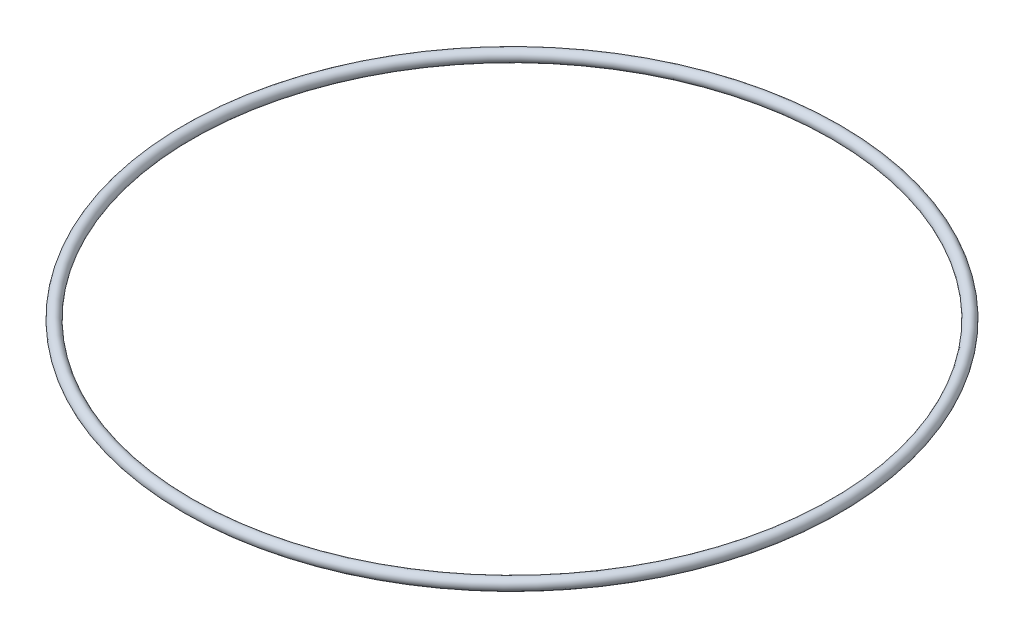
ISO-10303-21;
HEADER;
FILE_DESCRIPTION(('STEP AP214'),'2;1');
FILE_NAME('part.step','',(''),(''),'','','');
FILE_SCHEMA(('AUTOMOTIVE_DESIGN { 1 0 10303 214 1 1 1 1 }'));
ENDSEC;
DATA;
#1=APPLICATION_CONTEXT('core data for automotive mechanical design processes');
#2=APPLICATION_PROTOCOL_DEFINITION('international standard','automotive_design',2000,#1);
#3=PRODUCT_CONTEXT('',#1,'mechanical');
#4=PRODUCT('Part','Part','',(#3));
#5=PRODUCT_RELATED_PRODUCT_CATEGORY('part','',(#4));
#6=PRODUCT_DEFINITION_FORMATION('','',#4);
#7=PRODUCT_DEFINITION_CONTEXT('part definition',#1,'design');
#8=PRODUCT_DEFINITION('design','',#6,#7);
#9=PRODUCT_DEFINITION_SHAPE('','',#8);
#10=(LENGTH_UNIT() NAMED_UNIT(*) SI_UNIT(.MILLI.,.METRE.));
#11=(NAMED_UNIT(*) PLANE_ANGLE_UNIT() SI_UNIT($,.RADIAN.));
#12=(NAMED_UNIT(*) SI_UNIT($,.STERADIAN.) SOLID_ANGLE_UNIT());
#13=UNCERTAINTY_MEASURE_WITH_UNIT(LENGTH_MEASURE(1.E-05),#10,'distance_accuracy_value','');
#14=(GEOMETRIC_REPRESENTATION_CONTEXT(3) GLOBAL_UNCERTAINTY_ASSIGNED_CONTEXT((#13)) GLOBAL_UNIT_ASSIGNED_CONTEXT((#10,
#11,#12)) REPRESENTATION_CONTEXT('',''));
#15=CARTESIAN_POINT('',(0.,0.,0.));
#16=DIRECTION('',(0.,0.,1.));
#17=DIRECTION('',(1.,0.,0.));
#18=AXIS2_PLACEMENT_3D('',#15,#16,#17);
#19=CARTESIAN_POINT('',(-85.,0.,0.));
#20=DIRECTION('',(0.,1.,0.));
#21=DIRECTION('',(0.,0.,1.));
#22=AXIS2_PLACEMENT_3D('',#19,#20,#21);
#23=TOROIDAL_SURFACE('',#22,85.,1.5);
#24=CARTESIAN_POINT('',(-85.,0.,86.5));
#25=VERTEX_POINT('',#24);
#26=VERTEX_LOOP('',#25);
#27=FACE_BOUND('',#26,.T.);
#28=ADVANCED_FACE('F40',(#27),#23,.T.);
#29=CLOSED_SHELL('',(#28));
#30=MANIFOLD_SOLID_BREP('B2',#29);
#31=ADVANCED_BREP_SHAPE_REPRESENTATION('',(#18,#30),#14);
#32=SHAPE_DEFINITION_REPRESENTATION(#9,#31);
ENDSEC;
END-ISO-10303-21;
